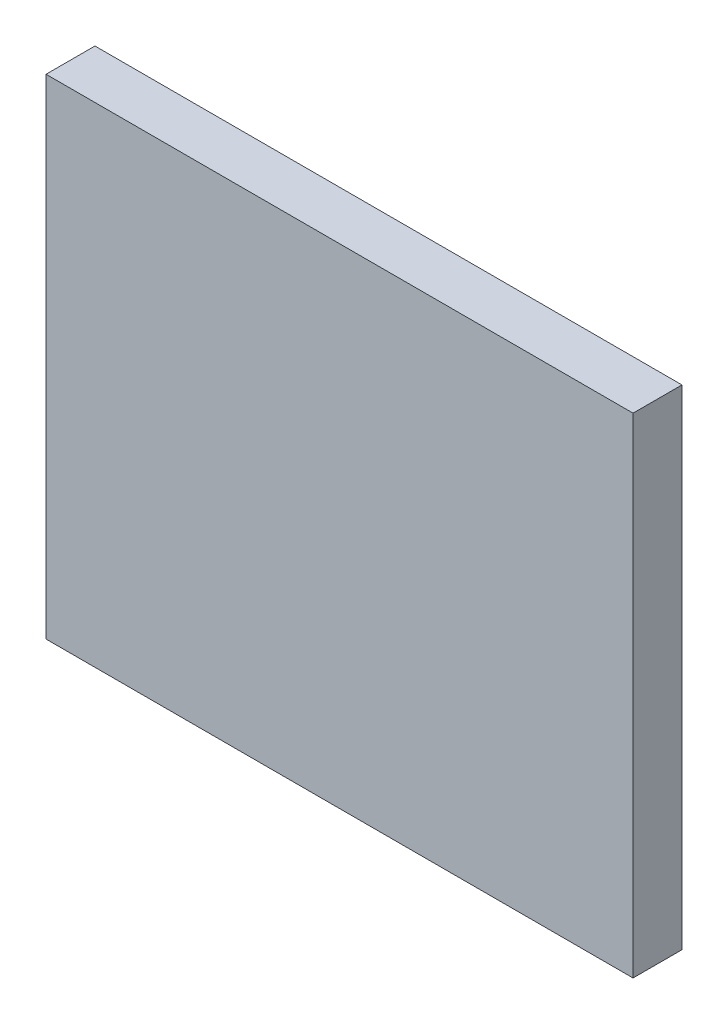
from build123d import *

# Parameters (mm, degrees)
ESQUISSE1_W          = 60
ESQUISSE1_H          = 50
BASE_EXTRUSION_DEPTH = 5


with BuildPart() as part:
    # Esquisse1 → Base-Extrusion (new body)
    with BuildSketch(Plane.XY):
        with Locations((30, -25)):
            Rectangle(ESQUISSE1_W, ESQUISSE1_H)
    extrude(amount=BASE_EXTRUSION_DEPTH)


solid = part.part
